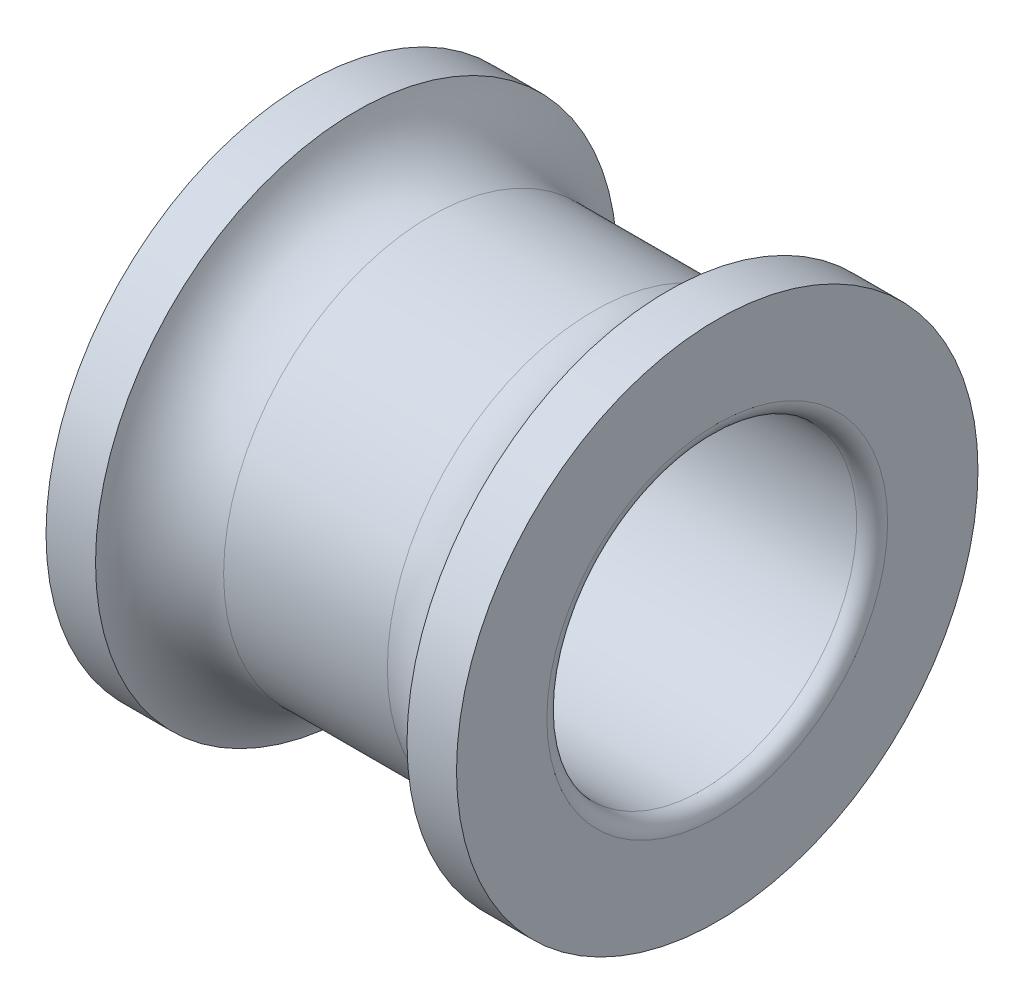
ISO-10303-21;
HEADER;
FILE_DESCRIPTION(('STEP AP214'),'2;1');
FILE_NAME('part.step','',(''),(''),'','','');
FILE_SCHEMA(('AUTOMOTIVE_DESIGN { 1 0 10303 214 1 1 1 1 }'));
ENDSEC;
DATA;
#1=APPLICATION_CONTEXT('core data for automotive mechanical design processes');
#2=APPLICATION_PROTOCOL_DEFINITION('international standard','automotive_design',2000,#1);
#3=PRODUCT_CONTEXT('',#1,'mechanical');
#4=PRODUCT('Part','Part','',(#3));
#5=PRODUCT_RELATED_PRODUCT_CATEGORY('part','',(#4));
#6=PRODUCT_DEFINITION_FORMATION('','',#4);
#7=PRODUCT_DEFINITION_CONTEXT('part definition',#1,'design');
#8=PRODUCT_DEFINITION('design','',#6,#7);
#9=PRODUCT_DEFINITION_SHAPE('','',#8);
#10=(LENGTH_UNIT() NAMED_UNIT(*) SI_UNIT(.MILLI.,.METRE.));
#11=(NAMED_UNIT(*) PLANE_ANGLE_UNIT() SI_UNIT($,.RADIAN.));
#12=(NAMED_UNIT(*) SI_UNIT($,.STERADIAN.) SOLID_ANGLE_UNIT());
#13=UNCERTAINTY_MEASURE_WITH_UNIT(LENGTH_MEASURE(1.E-05),#10,'distance_accuracy_value','');
#14=(GEOMETRIC_REPRESENTATION_CONTEXT(3) GLOBAL_UNCERTAINTY_ASSIGNED_CONTEXT((#13)) GLOBAL_UNIT_ASSIGNED_CONTEXT((#10,
#11,#12)) REPRESENTATION_CONTEXT('',''));
#15=CARTESIAN_POINT('',(0.,0.,0.));
#16=DIRECTION('',(0.,0.,1.));
#17=DIRECTION('',(1.,0.,0.));
#18=AXIS2_PLACEMENT_3D('',#15,#16,#17);
#19=CARTESIAN_POINT('',(15.3,0.,0.));
#20=DIRECTION('',(-1.,0.,0.));
#21=DIRECTION('',(0.,0.,1.));
#22=AXIS2_PLACEMENT_3D('',#19,#20,#21);
#23=TOROIDAL_SURFACE('',#22,6.6,0.6);
#24=CARTESIAN_POINT('',(15.9,0.,0.));
#25=DIRECTION('',(-1.,0.,0.));
#26=DIRECTION('',(0.,0.,1.));
#27=AXIS2_PLACEMENT_3D('',#24,#25,#26);
#28=CIRCLE('',#27,6.6);
#29=CARTESIAN_POINT('',(15.9,0.,6.6));
#30=VERTEX_POINT('',#29);
#31=EDGE_CURVE('E10',#30,#30,#28,.T.);
#32=ORIENTED_EDGE('',*,*,#31,.F.);
#33=EDGE_LOOP('',(#32));
#34=FACE_BOUND('',#33,.T.);
#35=CARTESIAN_POINT('',(15.3,0.,0.));
#36=DIRECTION('',(-1.,0.,0.));
#37=DIRECTION('',(0.,0.,1.));
#38=AXIS2_PLACEMENT_3D('',#35,#36,#37);
#39=CIRCLE('',#38,6.);
#40=CARTESIAN_POINT('',(15.3,0.,6.));
#41=VERTEX_POINT('',#40);
#42=EDGE_CURVE('E49',#41,#41,#39,.T.);
#43=ORIENTED_EDGE('',*,*,#42,.T.);
#44=EDGE_LOOP('',(#43));
#45=FACE_BOUND('',#44,.T.);
#46=ADVANCED_FACE('F15',(#34,#45),#23,.T.);
#47=CARTESIAN_POINT('',(15.9,6.6,0.));
#48=DIRECTION('',(-1.,0.,0.));
#49=DIRECTION('',(0.,0.,1.));
#50=AXIS2_PLACEMENT_3D('',#47,#48,#49);
#51=PLANE('',#50);
#52=CARTESIAN_POINT('',(15.9,0.,0.));
#53=DIRECTION('',(-1.,0.,0.));
#54=DIRECTION('',(0.,0.,1.));
#55=AXIS2_PLACEMENT_3D('',#52,#53,#54);
#56=CIRCLE('',#55,10.1);
#57=CARTESIAN_POINT('',(15.9,0.,10.1));
#58=VERTEX_POINT('',#57);
#59=EDGE_CURVE('E21',#58,#58,#56,.T.);
#60=ORIENTED_EDGE('',*,*,#59,.F.);
#61=EDGE_LOOP('',(#60));
#62=FACE_BOUND('',#61,.T.);
#63=ORIENTED_EDGE('',*,*,#31,.T.);
#64=EDGE_LOOP('',(#63));
#65=FACE_BOUND('',#64,.T.);
#66=ADVANCED_FACE('F91',(#62,#65),#51,.F.);
#67=CARTESIAN_POINT('',(0.,0.,0.));
#68=DIRECTION('',(-1.,0.,0.));
#69=DIRECTION('',(0.,0.,1.));
#70=AXIS2_PLACEMENT_3D('',#67,#68,#69);
#71=CYLINDRICAL_SURFACE('',#70,10.1);
#72=CARTESIAN_POINT('',(13.9824333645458,0.,0.));
#73=DIRECTION('',(-1.,0.,0.));
#74=DIRECTION('',(0.,0.,1.));
#75=AXIS2_PLACEMENT_3D('',#72,#73,#74);
#76=CIRCLE('',#75,10.1);
#77=CARTESIAN_POINT('',(13.9824333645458,0.,10.1));
#78=VERTEX_POINT('',#77);
#79=EDGE_CURVE('E25',#78,#78,#76,.T.);
#80=ORIENTED_EDGE('',*,*,#79,.F.);
#81=EDGE_LOOP('',(#80));
#82=FACE_BOUND('',#81,.T.);
#83=ORIENTED_EDGE('',*,*,#59,.T.);
#84=EDGE_LOOP('',(#83));
#85=FACE_BOUND('',#84,.T.);
#86=ADVANCED_FACE('F96',(#82,#85),#71,.T.);
#87=CARTESIAN_POINT('',(11.120615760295,0.,0.));
#88=DIRECTION('',(-1.,0.,0.));
#89=DIRECTION('',(0.,0.,1.));
#90=AXIS2_PLACEMENT_3D('',#87,#88,#89);
#91=TOROIDAL_SURFACE('',#90,11.,3.);
#92=ORIENTED_EDGE('',*,*,#79,.T.);
#93=EDGE_LOOP('',(#92));
#94=FACE_BOUND('',#93,.T.);
#95=CARTESIAN_POINT('',(11.120615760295,0.,0.));
#96=DIRECTION('',(-1.,0.,0.));
#97=DIRECTION('',(0.,0.,1.));
#98=AXIS2_PLACEMENT_3D('',#95,#96,#97);
#99=CIRCLE('',#98,8.);
#100=CARTESIAN_POINT('',(11.120615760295,0.,8.));
#101=VERTEX_POINT('',#100);
#102=EDGE_CURVE('E29',#101,#101,#99,.T.);
#103=ORIENTED_EDGE('',*,*,#102,.F.);
#104=EDGE_LOOP('',(#103));
#105=FACE_BOUND('',#104,.T.);
#106=ADVANCED_FACE('F87',(#94,#105),#91,.F.);
#107=CARTESIAN_POINT('',(0.,0.,0.));
#108=DIRECTION('',(-1.,0.,0.));
#109=DIRECTION('',(0.,0.,1.));
#110=AXIS2_PLACEMENT_3D('',#107,#108,#109);
#111=CYLINDRICAL_SURFACE('',#110,8.);
#112=ORIENTED_EDGE('',*,*,#102,.T.);
#113=EDGE_LOOP('',(#112));
#114=FACE_BOUND('',#113,.T.);
#115=CARTESIAN_POINT('',(4.77938423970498,0.,0.));
#116=DIRECTION('',(-1.,0.,0.));
#117=DIRECTION('',(0.,0.,1.));
#118=AXIS2_PLACEMENT_3D('',#115,#116,#117);
#119=CIRCLE('',#118,8.);
#120=CARTESIAN_POINT('',(4.77938423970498,0.,8.));
#121=VERTEX_POINT('',#120);
#122=EDGE_CURVE('E34',#121,#121,#119,.T.);
#123=ORIENTED_EDGE('',*,*,#122,.F.);
#124=EDGE_LOOP('',(#123));
#125=FACE_BOUND('',#124,.T.);
#126=ADVANCED_FACE('F80',(#114,#125),#111,.T.);
#127=CARTESIAN_POINT('',(4.77938423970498,0.,0.));
#128=DIRECTION('',(-1.,0.,0.));
#129=DIRECTION('',(0.,0.,1.));
#130=AXIS2_PLACEMENT_3D('',#127,#128,#129);
#131=TOROIDAL_SURFACE('',#130,11.,3.);
#132=ORIENTED_EDGE('',*,*,#122,.T.);
#133=EDGE_LOOP('',(#132));
#134=FACE_BOUND('',#133,.T.);
#135=CARTESIAN_POINT('',(1.91756663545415,0.,0.));
#136=DIRECTION('',(-1.,0.,0.));
#137=DIRECTION('',(0.,0.,1.));
#138=AXIS2_PLACEMENT_3D('',#135,#136,#137);
#139=CIRCLE('',#138,10.1);
#140=CARTESIAN_POINT('',(1.91756663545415,0.,10.1));
#141=VERTEX_POINT('',#140);
#142=EDGE_CURVE('E37',#141,#141,#139,.T.);
#143=ORIENTED_EDGE('',*,*,#142,.F.);
#144=EDGE_LOOP('',(#143));
#145=FACE_BOUND('',#144,.T.);
#146=ADVANCED_FACE('F75',(#134,#145),#131,.F.);
#147=CARTESIAN_POINT('',(0.,0.,0.));
#148=DIRECTION('',(-1.,0.,0.));
#149=DIRECTION('',(0.,0.,1.));
#150=AXIS2_PLACEMENT_3D('',#147,#148,#149);
#151=CYLINDRICAL_SURFACE('',#150,10.1);
#152=CARTESIAN_POINT('',(0.,0.,0.));
#153=DIRECTION('',(-1.,0.,0.));
#154=DIRECTION('',(0.,0.,1.));
#155=AXIS2_PLACEMENT_3D('',#152,#153,#154);
#156=CIRCLE('',#155,10.1);
#157=CARTESIAN_POINT('',(0.,0.,10.1));
#158=VERTEX_POINT('',#157);
#159=EDGE_CURVE('E40',#158,#158,#156,.T.);
#160=ORIENTED_EDGE('',*,*,#159,.F.);
#161=EDGE_LOOP('',(#160));
#162=FACE_BOUND('',#161,.T.);
#163=ORIENTED_EDGE('',*,*,#142,.T.);
#164=EDGE_LOOP('',(#163));
#165=FACE_BOUND('',#164,.T.);
#166=ADVANCED_FACE('F69',(#162,#165),#151,.T.);
#167=CARTESIAN_POINT('',(0.,10.1,0.));
#168=DIRECTION('',(1.,0.,0.));
#169=DIRECTION('',(0.,0.,-1.));
#170=AXIS2_PLACEMENT_3D('',#167,#168,#169);
#171=PLANE('',#170);
#172=CARTESIAN_POINT('',(0.,0.,0.));
#173=DIRECTION('',(-1.,0.,0.));
#174=DIRECTION('',(0.,0.,1.));
#175=AXIS2_PLACEMENT_3D('',#172,#173,#174);
#176=CIRCLE('',#175,6.6);
#177=CARTESIAN_POINT('',(0.,0.,6.6));
#178=VERTEX_POINT('',#177);
#179=EDGE_CURVE('E43',#178,#178,#176,.T.);
#180=ORIENTED_EDGE('',*,*,#179,.F.);
#181=EDGE_LOOP('',(#180));
#182=FACE_BOUND('',#181,.T.);
#183=ORIENTED_EDGE('',*,*,#159,.T.);
#184=EDGE_LOOP('',(#183));
#185=FACE_BOUND('',#184,.T.);
#186=ADVANCED_FACE('F63',(#182,#185),#171,.F.);
#187=CARTESIAN_POINT('',(0.6,0.,0.));
#188=DIRECTION('',(-1.,0.,0.));
#189=DIRECTION('',(0.,0.,1.));
#190=AXIS2_PLACEMENT_3D('',#187,#188,#189);
#191=TOROIDAL_SURFACE('',#190,6.6,0.6);
#192=CARTESIAN_POINT('',(0.6,0.,0.));
#193=DIRECTION('',(-1.,0.,0.));
#194=DIRECTION('',(0.,0.,1.));
#195=AXIS2_PLACEMENT_3D('',#192,#193,#194);
#196=CIRCLE('',#195,6.);
#197=CARTESIAN_POINT('',(0.6,0.,6.));
#198=VERTEX_POINT('',#197);
#199=EDGE_CURVE('E46',#198,#198,#196,.T.);
#200=ORIENTED_EDGE('',*,*,#199,.F.);
#201=EDGE_LOOP('',(#200));
#202=FACE_BOUND('',#201,.T.);
#203=ORIENTED_EDGE('',*,*,#179,.T.);
#204=EDGE_LOOP('',(#203));
#205=FACE_BOUND('',#204,.T.);
#206=ADVANCED_FACE('F57',(#202,#205),#191,.T.);
#207=CARTESIAN_POINT('',(0.,0.,0.));
#208=DIRECTION('',(-1.,0.,0.));
#209=DIRECTION('',(0.,0.,1.));
#210=AXIS2_PLACEMENT_3D('',#207,#208,#209);
#211=CYLINDRICAL_SURFACE('',#210,6.);
#212=ORIENTED_EDGE('',*,*,#42,.F.);
#213=EDGE_LOOP('',(#212));
#214=FACE_BOUND('',#213,.T.);
#215=ORIENTED_EDGE('',*,*,#199,.T.);
#216=EDGE_LOOP('',(#215));
#217=FACE_BOUND('',#216,.T.);
#218=ADVANCED_FACE('F54',(#214,#217),#211,.F.);
#219=CLOSED_SHELL('',(#46,#66,#86,#106,#126,#146,#166,#186,#206,#218));
#220=MANIFOLD_SOLID_BREP('B1',#219);
#221=ADVANCED_BREP_SHAPE_REPRESENTATION('',(#18,#220),#14);
#222=SHAPE_DEFINITION_REPRESENTATION(#9,#221);
ENDSEC;
END-ISO-10303-21;
